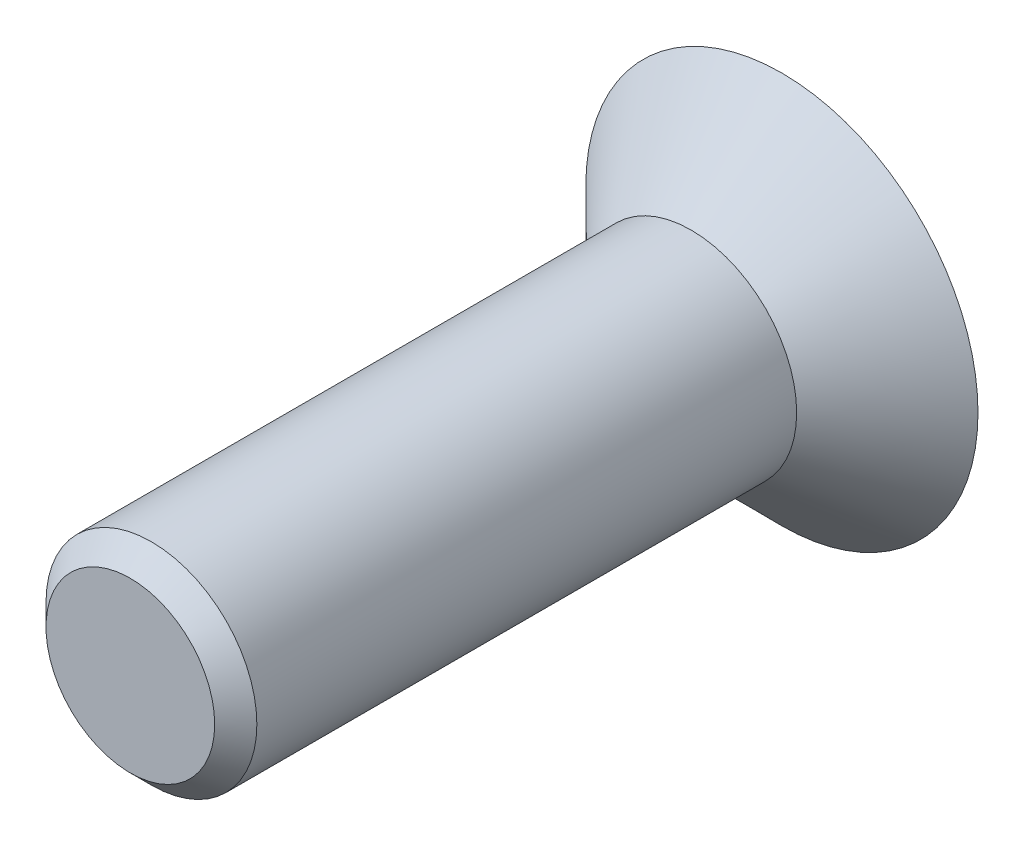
ISO-10303-21;
HEADER;
FILE_DESCRIPTION(('STEP AP214'),'2;1');
FILE_NAME('part.step','',(''),(''),'','','');
FILE_SCHEMA(('AUTOMOTIVE_DESIGN { 1 0 10303 214 1 1 1 1 }'));
ENDSEC;
DATA;
#1=APPLICATION_CONTEXT('core data for automotive mechanical design processes');
#2=APPLICATION_PROTOCOL_DEFINITION('international standard','automotive_design',2000,#1);
#3=PRODUCT_CONTEXT('',#1,'mechanical');
#4=PRODUCT('Part','Part','',(#3));
#5=PRODUCT_RELATED_PRODUCT_CATEGORY('part','',(#4));
#6=PRODUCT_DEFINITION_FORMATION('','',#4);
#7=PRODUCT_DEFINITION_CONTEXT('part definition',#1,'design');
#8=PRODUCT_DEFINITION('design','',#6,#7);
#9=PRODUCT_DEFINITION_SHAPE('','',#8);
#10=(LENGTH_UNIT() NAMED_UNIT(*) SI_UNIT(.MILLI.,.METRE.));
#11=(NAMED_UNIT(*) PLANE_ANGLE_UNIT() SI_UNIT($,.RADIAN.));
#12=(NAMED_UNIT(*) SI_UNIT($,.STERADIAN.) SOLID_ANGLE_UNIT());
#13=UNCERTAINTY_MEASURE_WITH_UNIT(LENGTH_MEASURE(1.E-05),#10,'distance_accuracy_value','');
#14=(GEOMETRIC_REPRESENTATION_CONTEXT(3) GLOBAL_UNCERTAINTY_ASSIGNED_CONTEXT((#13)) GLOBAL_UNIT_ASSIGNED_CONTEXT((#10,
#11,#12)) REPRESENTATION_CONTEXT('',''));
#15=CARTESIAN_POINT('',(0.,0.,0.));
#16=DIRECTION('',(0.,0.,1.));
#17=DIRECTION('',(1.,0.,0.));
#18=AXIS2_PLACEMENT_3D('',#15,#16,#17);
#19=CARTESIAN_POINT('',(0.,0.,-2.14999999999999));
#20=DIRECTION('',(0.,0.,1.));
#21=DIRECTION('',(1.,0.,0.));
#22=AXIS2_PLACEMENT_3D('',#19,#20,#21);
#23=PLANE('',#22);
#24=CARTESIAN_POINT('',(0.,0.,-2.14999999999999));
#25=DIRECTION('',(0.,0.,-1.));
#26=DIRECTION('',(-1.,0.,0.));
#27=AXIS2_PLACEMENT_3D('',#24,#25,#26);
#28=CIRCLE('',#27,4.65);
#29=CARTESIAN_POINT('',(-4.65,0.,-2.15));
#30=VERTEX_POINT('',#29);
#31=EDGE_CURVE('E426',#30,#30,#28,.T.);
#32=ORIENTED_EDGE('',*,*,#31,.T.);
#33=EDGE_LOOP('',(#32));
#34=FACE_BOUND('',#33,.T.);
#35=DIRECTION('',(-0.86602540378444,0.499999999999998,0.));
#36=VECTOR('',#35,1.);
#37=CARTESIAN_POINT('',(0.,1.73205080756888,-2.14999999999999));
#38=LINE('',#37,#36);
#39=CARTESIAN_POINT('',(1.5,0.866025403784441,-2.14999999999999));
#40=VERTEX_POINT('',#39);
#41=CARTESIAN_POINT('',(0.,1.73205080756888,-2.14999999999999));
#42=VERTEX_POINT('',#41);
#43=EDGE_CURVE('E383',#40,#42,#38,.T.);
#44=ORIENTED_EDGE('',*,*,#43,.T.);
#45=DIRECTION('',(-0.866025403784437,-0.500000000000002,0.));
#46=VECTOR('',#45,1.);
#47=CARTESIAN_POINT('',(-1.5,0.866025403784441,-2.14999999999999));
#48=LINE('',#47,#46);
#49=CARTESIAN_POINT('',(-1.5,0.866025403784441,-2.14999999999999));
#50=VERTEX_POINT('',#49);
#51=EDGE_CURVE('E484',#42,#50,#48,.T.);
#52=ORIENTED_EDGE('',*,*,#51,.T.);
#53=DIRECTION('',(0.,-1.,0.));
#54=VECTOR('',#53,1.);
#55=CARTESIAN_POINT('',(-1.5,-0.866025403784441,-2.14999999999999));
#56=LINE('',#55,#54);
#57=CARTESIAN_POINT('',(-1.5,-0.866025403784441,-2.14999999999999));
#58=VERTEX_POINT('',#57);
#59=EDGE_CURVE('E487',#50,#58,#56,.T.);
#60=ORIENTED_EDGE('',*,*,#59,.T.);
#61=DIRECTION('',(0.866025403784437,-0.500000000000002,0.));
#62=VECTOR('',#61,1.);
#63=CARTESIAN_POINT('',(-1.5,-0.866025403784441,-2.14999999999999));
#64=LINE('',#63,#62);
#65=CARTESIAN_POINT('',(0.,-1.73205080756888,-2.14999999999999));
#66=VERTEX_POINT('',#65);
#67=EDGE_CURVE('E493',#58,#66,#64,.T.);
#68=ORIENTED_EDGE('',*,*,#67,.T.);
#69=DIRECTION('',(0.86602540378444,0.499999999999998,0.));
#70=VECTOR('',#69,1.);
#71=CARTESIAN_POINT('',(0.,-1.73205080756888,-2.14999999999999));
#72=LINE('',#71,#70);
#73=CARTESIAN_POINT('',(1.5,-0.866025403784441,-2.14999999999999));
#74=VERTEX_POINT('',#73);
#75=EDGE_CURVE('E496',#66,#74,#72,.T.);
#76=ORIENTED_EDGE('',*,*,#75,.T.);
#77=DIRECTION('',(0.,1.,0.));
#78=VECTOR('',#77,1.);
#79=CARTESIAN_POINT('',(1.5,-0.866025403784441,-2.14999999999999));
#80=LINE('',#79,#78);
#81=EDGE_CURVE('E432',#74,#40,#80,.T.);
#82=ORIENTED_EDGE('',*,*,#81,.T.);
#83=EDGE_LOOP('',(#44,#52,#60,#68,#76,#82));
#84=FACE_BOUND('',#83,.T.);
#85=ADVANCED_FACE('F369',(#34,#84),#23,.F.);
#86=CARTESIAN_POINT('',(0.,0.,0.));
#87=DIRECTION('',(0.,0.,-1.));
#88=DIRECTION('',(-1.,0.,0.));
#89=AXIS2_PLACEMENT_3D('',#86,#87,#88);
#90=CONICAL_SURFACE('',#89,2.5,0.78539816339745);
#91=ORIENTED_EDGE('',*,*,#31,.F.);
#92=EDGE_LOOP('',(#91));
#93=FACE_BOUND('',#92,.T.);
#94=CARTESIAN_POINT('',(0.,0.,0.));
#95=DIRECTION('',(0.,0.,1.));
#96=DIRECTION('',(1.,0.,0.));
#97=AXIS2_PLACEMENT_3D('',#94,#95,#96);
#98=CIRCLE('',#97,2.5);
#99=CARTESIAN_POINT('',(2.5,0.,0.));
#100=VERTEX_POINT('',#99);
#101=EDGE_CURVE('E485',#100,#100,#98,.T.);
#102=ORIENTED_EDGE('',*,*,#101,.F.);
#103=EDGE_LOOP('',(#102));
#104=FACE_BOUND('',#103,.T.);
#105=ADVANCED_FACE('F470',(#93,#104),#90,.T.);
#106=CARTESIAN_POINT('',(0.,1.73205080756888,0.250000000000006));
#107=DIRECTION('',(-0.499999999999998,-0.86602540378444,0.));
#108=DIRECTION('',(0.86602540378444,-0.499999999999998,0.));
#109=AXIS2_PLACEMENT_3D('',#106,#107,#108);
#110=PLANE('',#109);
#111=DIRECTION('',(-0.86602540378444,0.499999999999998,0.));
#112=VECTOR('',#111,1.);
#113=CARTESIAN_POINT('',(0.749999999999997,1.29903810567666,0.));
#114=LINE('',#113,#112);
#115=CARTESIAN_POINT('',(1.5,0.866025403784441,0.));
#116=VERTEX_POINT('',#115);
#117=CARTESIAN_POINT('',(0.,1.73205080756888,0.));
#118=VERTEX_POINT('',#117);
#119=EDGE_CURVE('E391',#116,#118,#114,.T.);
#120=ORIENTED_EDGE('',*,*,#119,.T.);
#121=DIRECTION('',(0.,0.,-1.));
#122=VECTOR('',#121,1.);
#123=CARTESIAN_POINT('',(0.,1.73205080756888,0.250000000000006));
#124=LINE('',#123,#122);
#125=EDGE_CURVE('E505',#118,#42,#124,.T.);
#126=ORIENTED_EDGE('',*,*,#125,.T.);
#127=ORIENTED_EDGE('',*,*,#43,.F.);
#128=DIRECTION('',(0.,0.,-1.));
#129=VECTOR('',#128,1.);
#130=CARTESIAN_POINT('',(1.5,0.866025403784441,0.250000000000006));
#131=LINE('',#130,#129);
#132=EDGE_CURVE('E437',#116,#40,#131,.T.);
#133=ORIENTED_EDGE('',*,*,#132,.F.);
#134=EDGE_LOOP('',(#120,#126,#127,#133));
#135=FACE_BOUND('',#134,.T.);
#136=ADVANCED_FACE('F476',(#135),#110,.T.);
#137=CARTESIAN_POINT('',(-1.5,0.866025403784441,0.250000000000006));
#138=DIRECTION('',(0.500000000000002,-0.866025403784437,0.));
#139=DIRECTION('',(0.866025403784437,0.500000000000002,0.));
#140=AXIS2_PLACEMENT_3D('',#137,#138,#139);
#141=PLANE('',#140);
#142=DIRECTION('',(-0.866025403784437,-0.500000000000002,0.));
#143=VECTOR('',#142,1.);
#144=CARTESIAN_POINT('',(-0.750000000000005,1.29903810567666,0.));
#145=LINE('',#144,#143);
#146=CARTESIAN_POINT('',(-1.5,0.866025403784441,0.));
#147=VERTEX_POINT('',#146);
#148=EDGE_CURVE('E449',#118,#147,#145,.T.);
#149=ORIENTED_EDGE('',*,*,#148,.T.);
#150=DIRECTION('',(0.,0.,-1.));
#151=VECTOR('',#150,1.);
#152=CARTESIAN_POINT('',(-1.5,0.866025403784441,0.250000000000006));
#153=LINE('',#152,#151);
#154=EDGE_CURVE('E503',#147,#50,#153,.T.);
#155=ORIENTED_EDGE('',*,*,#154,.T.);
#156=ORIENTED_EDGE('',*,*,#51,.F.);
#157=ORIENTED_EDGE('',*,*,#125,.F.);
#158=EDGE_LOOP('',(#149,#155,#156,#157));
#159=FACE_BOUND('',#158,.T.);
#160=ADVANCED_FACE('F508',(#159),#141,.T.);
#161=CARTESIAN_POINT('',(-1.5,-0.866025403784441,0.250000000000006));
#162=DIRECTION('',(1.,0.,0.));
#163=DIRECTION('',(0.,0.,-1.));
#164=AXIS2_PLACEMENT_3D('',#161,#162,#163);
#165=PLANE('',#164);
#166=DIRECTION('',(0.,-1.,0.));
#167=VECTOR('',#166,1.);
#168=CARTESIAN_POINT('',(-1.5,0.,0.));
#169=LINE('',#168,#167);
#170=CARTESIAN_POINT('',(-1.5,-0.866025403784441,0.));
#171=VERTEX_POINT('',#170);
#172=EDGE_CURVE('E443',#147,#171,#169,.T.);
#173=ORIENTED_EDGE('',*,*,#172,.T.);
#174=DIRECTION('',(0.,0.,-1.));
#175=VECTOR('',#174,1.);
#176=CARTESIAN_POINT('',(-1.5,-0.866025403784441,0.250000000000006));
#177=LINE('',#176,#175);
#178=EDGE_CURVE('E501',#171,#58,#177,.T.);
#179=ORIENTED_EDGE('',*,*,#178,.T.);
#180=ORIENTED_EDGE('',*,*,#59,.F.);
#181=ORIENTED_EDGE('',*,*,#154,.F.);
#182=EDGE_LOOP('',(#173,#179,#180,#181));
#183=FACE_BOUND('',#182,.T.);
#184=ADVANCED_FACE('F512',(#183),#165,.T.);
#185=CARTESIAN_POINT('',(-1.5,-0.866025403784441,0.250000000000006));
#186=DIRECTION('',(0.500000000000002,0.866025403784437,0.));
#187=DIRECTION('',(-0.866025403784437,0.500000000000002,0.));
#188=AXIS2_PLACEMENT_3D('',#185,#186,#187);
#189=PLANE('',#188);
#190=DIRECTION('',(0.866025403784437,-0.500000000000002,0.));
#191=VECTOR('',#190,1.);
#192=CARTESIAN_POINT('',(-0.750000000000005,-1.29903810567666,0.));
#193=LINE('',#192,#191);
#194=CARTESIAN_POINT('',(0.,-1.73205080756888,0.));
#195=VERTEX_POINT('',#194);
#196=EDGE_CURVE('E441',#171,#195,#193,.T.);
#197=ORIENTED_EDGE('',*,*,#196,.T.);
#198=DIRECTION('',(0.,0.,-1.));
#199=VECTOR('',#198,1.);
#200=CARTESIAN_POINT('',(0.,-1.73205080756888,0.250000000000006));
#201=LINE('',#200,#199);
#202=EDGE_CURVE('E436',#195,#66,#201,.T.);
#203=ORIENTED_EDGE('',*,*,#202,.T.);
#204=ORIENTED_EDGE('',*,*,#67,.F.);
#205=ORIENTED_EDGE('',*,*,#178,.F.);
#206=EDGE_LOOP('',(#197,#203,#204,#205));
#207=FACE_BOUND('',#206,.T.);
#208=ADVANCED_FACE('F516',(#207),#189,.T.);
#209=CARTESIAN_POINT('',(0.,-1.73205080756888,0.250000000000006));
#210=DIRECTION('',(-0.499999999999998,0.86602540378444,0.));
#211=DIRECTION('',(-0.86602540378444,-0.499999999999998,0.));
#212=AXIS2_PLACEMENT_3D('',#209,#210,#211);
#213=PLANE('',#212);
#214=DIRECTION('',(0.86602540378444,0.499999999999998,0.));
#215=VECTOR('',#214,1.);
#216=CARTESIAN_POINT('',(0.749999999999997,-1.29903810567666,0.));
#217=LINE('',#216,#215);
#218=CARTESIAN_POINT('',(1.5,-0.866025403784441,0.));
#219=VERTEX_POINT('',#218);
#220=EDGE_CURVE('E423',#195,#219,#217,.T.);
#221=ORIENTED_EDGE('',*,*,#220,.T.);
#222=DIRECTION('',(0.,0.,-1.));
#223=VECTOR('',#222,1.);
#224=CARTESIAN_POINT('',(1.5,-0.866025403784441,0.250000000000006));
#225=LINE('',#224,#223);
#226=EDGE_CURVE('E429',#219,#74,#225,.T.);
#227=ORIENTED_EDGE('',*,*,#226,.T.);
#228=ORIENTED_EDGE('',*,*,#75,.F.);
#229=ORIENTED_EDGE('',*,*,#202,.F.);
#230=EDGE_LOOP('',(#221,#227,#228,#229));
#231=FACE_BOUND('',#230,.T.);
#232=ADVANCED_FACE('F440',(#231),#213,.T.);
#233=CARTESIAN_POINT('',(1.5,-0.866025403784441,0.250000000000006));
#234=DIRECTION('',(-1.,0.,0.));
#235=DIRECTION('',(0.,0.,1.));
#236=AXIS2_PLACEMENT_3D('',#233,#234,#235);
#237=PLANE('',#236);
#238=DIRECTION('',(0.,1.,0.));
#239=VECTOR('',#238,1.);
#240=CARTESIAN_POINT('',(1.5,0.,0.));
#241=LINE('',#240,#239);
#242=EDGE_CURVE('E419',#219,#116,#241,.T.);
#243=ORIENTED_EDGE('',*,*,#242,.T.);
#244=ORIENTED_EDGE('',*,*,#132,.T.);
#245=ORIENTED_EDGE('',*,*,#81,.F.);
#246=ORIENTED_EDGE('',*,*,#226,.F.);
#247=EDGE_LOOP('',(#243,#244,#245,#246));
#248=FACE_BOUND('',#247,.T.);
#249=ADVANCED_FACE('F430',(#248),#237,.T.);
#250=CARTESIAN_POINT('',(0.,0.,0.));
#251=DIRECTION('',(0.,0.,-1.));
#252=DIRECTION('',(-1.,0.,0.));
#253=AXIS2_PLACEMENT_3D('',#250,#251,#252);
#254=PLANE('',#253);
#255=ORIENTED_EDGE('',*,*,#148,.F.);
#256=ORIENTED_EDGE('',*,*,#119,.F.);
#257=ORIENTED_EDGE('',*,*,#242,.F.);
#258=ORIENTED_EDGE('',*,*,#220,.F.);
#259=ORIENTED_EDGE('',*,*,#196,.F.);
#260=ORIENTED_EDGE('',*,*,#172,.F.);
#261=EDGE_LOOP('',(#255,#256,#257,#258,#259,#260));
#262=FACE_BOUND('',#261,.T.);
#263=ADVANCED_FACE('F421',(#262),#254,.T.);
#264=CARTESIAN_POINT('',(0.,0.,13.3));
#265=DIRECTION('',(0.,0.,1.));
#266=DIRECTION('',(1.,0.,0.));
#267=AXIS2_PLACEMENT_3D('',#264,#265,#266);
#268=PLANE('',#267);
#269=CARTESIAN_POINT('',(0.,0.,13.3));
#270=DIRECTION('',(0.,0.,1.));
#271=DIRECTION('',(1.,0.,0.));
#272=AXIS2_PLACEMENT_3D('',#269,#270,#271);
#273=CIRCLE('',#272,2.);
#274=CARTESIAN_POINT('',(2.,0.,13.3));
#275=VERTEX_POINT('',#274);
#276=EDGE_CURVE('E376',#275,#275,#273,.T.);
#277=ORIENTED_EDGE('',*,*,#276,.T.);
#278=EDGE_LOOP('',(#277));
#279=FACE_BOUND('',#278,.T.);
#280=ADVANCED_FACE('F455',(#279),#268,.T.);
#281=CARTESIAN_POINT('',(0.,0.,0.));
#282=DIRECTION('',(0.,0.,1.));
#283=DIRECTION('',(1.,0.,0.));
#284=AXIS2_PLACEMENT_3D('',#281,#282,#283);
#285=CYLINDRICAL_SURFACE('',#284,2.5);
#286=CARTESIAN_POINT('',(0.,0.,12.8));
#287=DIRECTION('',(0.,0.,1.));
#288=DIRECTION('',(1.,0.,0.));
#289=AXIS2_PLACEMENT_3D('',#286,#287,#288);
#290=CIRCLE('',#289,2.5);
#291=CARTESIAN_POINT('',(2.5,0.,12.8));
#292=VERTEX_POINT('',#291);
#293=EDGE_CURVE('E11',#292,#292,#290,.F.);
#294=ORIENTED_EDGE('',*,*,#293,.T.);
#295=EDGE_LOOP('',(#294));
#296=FACE_BOUND('',#295,.T.);
#297=ORIENTED_EDGE('',*,*,#101,.T.);
#298=EDGE_LOOP('',(#297));
#299=FACE_BOUND('',#298,.T.);
#300=ADVANCED_FACE('F459',(#296,#299),#285,.T.);
#301=CARTESIAN_POINT('',(0.,0.,13.3));
#302=DIRECTION('',(0.,0.,-1.));
#303=DIRECTION('',(-1.,0.,0.));
#304=AXIS2_PLACEMENT_3D('',#301,#302,#303);
#305=CONICAL_SURFACE('',#304,2.,0.785398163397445);
#306=ORIENTED_EDGE('',*,*,#293,.F.);
#307=EDGE_LOOP('',(#306));
#308=FACE_BOUND('',#307,.T.);
#309=ORIENTED_EDGE('',*,*,#276,.F.);
#310=EDGE_LOOP('',(#309));
#311=FACE_BOUND('',#310,.T.);
#312=ADVANCED_FACE('F457',(#308,#311),#305,.T.);
#313=CLOSED_SHELL('',(#85,#105,#136,#160,#184,#208,#232,#249,#263,#280,#300,#312));
#314=MANIFOLD_SOLID_BREP('B2',#313);
#315=ADVANCED_BREP_SHAPE_REPRESENTATION('',(#18,#314),#14);
#316=SHAPE_DEFINITION_REPRESENTATION(#9,#315);
ENDSEC;
END-ISO-10303-21;
